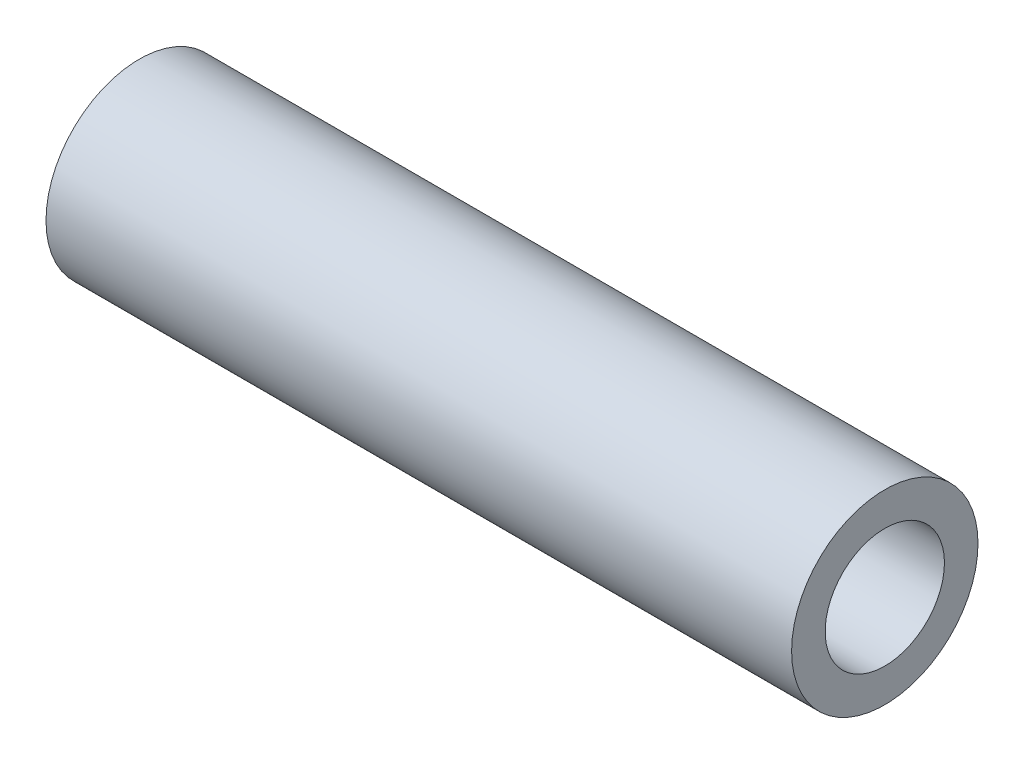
from build123d import *

# Parameters (mm, degrees)
ESQUISSE1_R        = 25
ESQUISSE1_R_2      = 16
BOSS_EXTRU_1_DEPTH = 100


with BuildPart() as part:
    # Esquisse1 → Boss.-Extru.1 (new, symmetric)
    with BuildSketch(Plane(origin=(0, 0, 0), x_dir=(0, 0, -1), z_dir=(1, 0, 0))):
        Circle(ESQUISSE1_R)
        Circle(ESQUISSE1_R_2, mode=Mode.SUBTRACT)
    extrude(amount=BOSS_EXTRU_1_DEPTH, both=True)


solid = part.part
